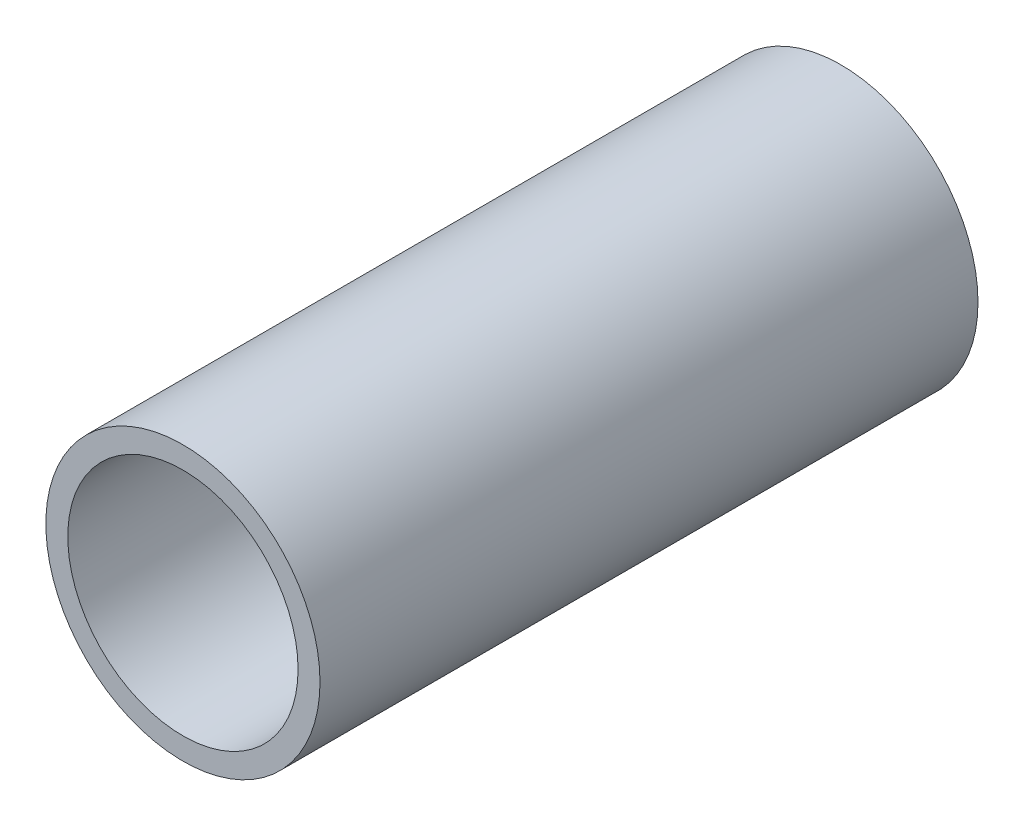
from build123d import *

# Parameters (mm, degrees)
ESQUISSE1_R        = 12.5
ESQUISSE1_R_2      = 10.5
BOSS_EXTRU_1_DEPTH = 60


with BuildPart() as part:
    # Esquisse1 → Boss.-Extru.1 (new body)
    with BuildSketch(Plane(origin=(0, 0, 0), x_dir=(-1, 0, 0), z_dir=(0, 0, 1))):
        with Locations(Location((0, 0, 0), (0, 0, 180))):
            Circle(ESQUISSE1_R)
        with Locations(Location((0, 0, 0), (0, 0, 180))):
            Circle(ESQUISSE1_R_2, mode=Mode.SUBTRACT)
    extrude(amount=BOSS_EXTRU_1_DEPTH)


solid = part.part
